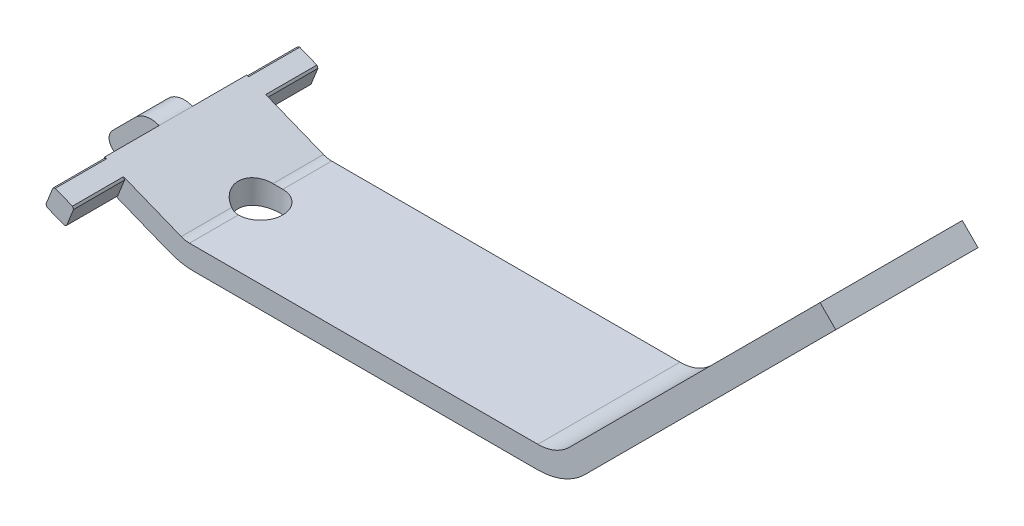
from build123d import *

# Parameters (mm, degrees)
BOSS_EXTRU_1_DEPTH           = 3.2
BOSS_EXTRU_2_DEPTH           = 5.5
ESQUISSE3_OUTSIDE_W          = 42.742
ESQUISSE3_OUTSIDE_H          = 22.342
ESQUISSE3_OUTSIDE_R          = 0.65
ENL_V_MAT_EXTRU_1_DEPTH      = 2.3
ESQUISSE4_OUTSIDE_W          = 42.742
ESQUISSE4_OUTSIDE_H          = 22.342
ESQUISSE4_OUTSIDE_R          = 0.65
ENL_V_MAT_EXTRU_2_DEPTH      = 2.3
BOSS_EXTRU_3_DEPTH           = 0.75
CONG_1_R                     = 3
CONG_2_R                     = 1
ENL_V_MAT_EXTRU_3_DEPTH      = 36.150746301
ENL_V_MAT_EXTRU_3_DEPTH_BACK = 36.150746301
ESQUISSE7_R                  = 1


with BuildPart() as part:
    # Esquisse1 → Boss.-Extru.1 (new, symmetric)
    with BuildSketch(Plane.XY):
        with BuildLine():
            Line((-0.185714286, -0.464230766), (3.153313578, -1.8))
            Line((3.153313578, -1.8), (19.214081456, -1.8))
            ThreePointArc((19.214081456, -1.8), (20.362131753, -1.571638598), (21.335401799, -0.921320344))
            Line((21.335401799, -0.921320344), (32.623984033, 10.36726189))
            Line((32.623984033, 10.36726189), (31.916877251, 11.074368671))
            Line((31.916877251, 11.074368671), (20.628295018, -0.214213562))
            ThreePointArc((20.628295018, -0.214213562), (19.979448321, -0.647759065), (19.214081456, -0.8))
            Line((19.214081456, -0.8), (3.345917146, -0.8))
            Line((3.345917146, -0.8), (0.185714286, 0.464230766))
            Line((0.185714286, 0.464230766), (-0.27851648, 0.649945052))
            Line((-0.27851648, 0.649945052), (-0.649945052, -0.27851648))
            Line((-0.649945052, -0.27851648), (-0.185714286, -0.464230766))
        make_face()
    extrude(amount=BOSS_EXTRU_1_DEPTH, both=True)

    # Esquisse2 → Boss.-Extru.2 (add, symmetric)
    with BuildSketch(Plane.XY):
        Polygon((-0.27851648, 0.649945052), (-0.649945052, -0.27851648), (0.27851648, -0.649945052), (0.649945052, 0.27851648), align=None)
    extrude(amount=BOSS_EXTRU_2_DEPTH, both=True)

    # Esquisse3 outside → Enl_v. mat.-Extru.1 (cut)
    with BuildSketch(Plane.XY.offset(5.5)):
        with Locations((15.987, 4.637)):
            Rectangle(ESQUISSE3_OUTSIDE_W, ESQUISSE3_OUTSIDE_H)
        Circle(ESQUISSE3_OUTSIDE_R, mode=Mode.SUBTRACT)
    extrude(amount=-ENL_V_MAT_EXTRU_1_DEPTH, mode=Mode.SUBTRACT)

    # Esquisse4 outside → Enl_v. mat.-Extru.2 (cut)
    with BuildSketch(Plane(origin=(0, 0, -5.5), x_dir=(-1, 0, 0), z_dir=(0, 0, -1))):
        with Locations((-15.987, 4.637)):
            Rectangle(ESQUISSE4_OUTSIDE_W, ESQUISSE4_OUTSIDE_H)
        Circle(ESQUISSE4_OUTSIDE_R, mode=Mode.SUBTRACT)
    extrude(amount=-ENL_V_MAT_EXTRU_2_DEPTH, mode=Mode.SUBTRACT)

    # Esquisse6 → Boss.-Extru.3 (add, symmetric)
    with BuildSketch(Plane.XY):
        with BuildLine():
            Line((-0.649945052, -0.27851648), (-1.674981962, -1.303553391))
            ThreePointArc((-1.674981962, -1.303553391), (-2.382088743, -1.303553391), (-2.382088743, -0.596446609))
            Line((-2.382088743, -0.596446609), (-1.357051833, 0.428590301))
            ThreePointArc((-1.357051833, 0.428590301), (-0.850990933, 0.701065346), (-0.27851648, 0.649945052))
            Line((-0.27851648, 0.649945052), (-0.649945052, -0.27851648))
        make_face()
    extrude(amount=BOSS_EXTRU_3_DEPTH, both=True)

    # Cong_1
    cong_1_edges = [part.edges().sort_by_distance(p)[0] for p in [
        (3.153313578, -1.8, 0),
    ]]
    fillet(cong_1_edges, radius=CONG_1_R)

    # Cong_2
    cong_2_edges = [part.edges().sort_by_distance(p)[0] for p in [
        (3.345917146, -0.8, 0),
    ]]
    fillet(cong_2_edges, radius=CONG_2_R)

    # Esquisse7 → Enl_v. mat.-Extru.3 (cut, two sides: drawn at the far end of the back side and taken through both)
    with BuildSketch(Plane(origin=(0, -0.8, 0), x_dir=(1, 0, 0), z_dir=(0, 1, 0)).offset(-ENL_V_MAT_EXTRU_3_DEPTH_BACK)):
        with Locations(Location((3.538520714, 0, 0), (0, 0, 270))):
            Circle(ESQUISSE7_R)
    extrude(amount=ENL_V_MAT_EXTRU_3_DEPTH + ENL_V_MAT_EXTRU_3_DEPTH_BACK, mode=Mode.SUBTRACT)


solid = part.part
